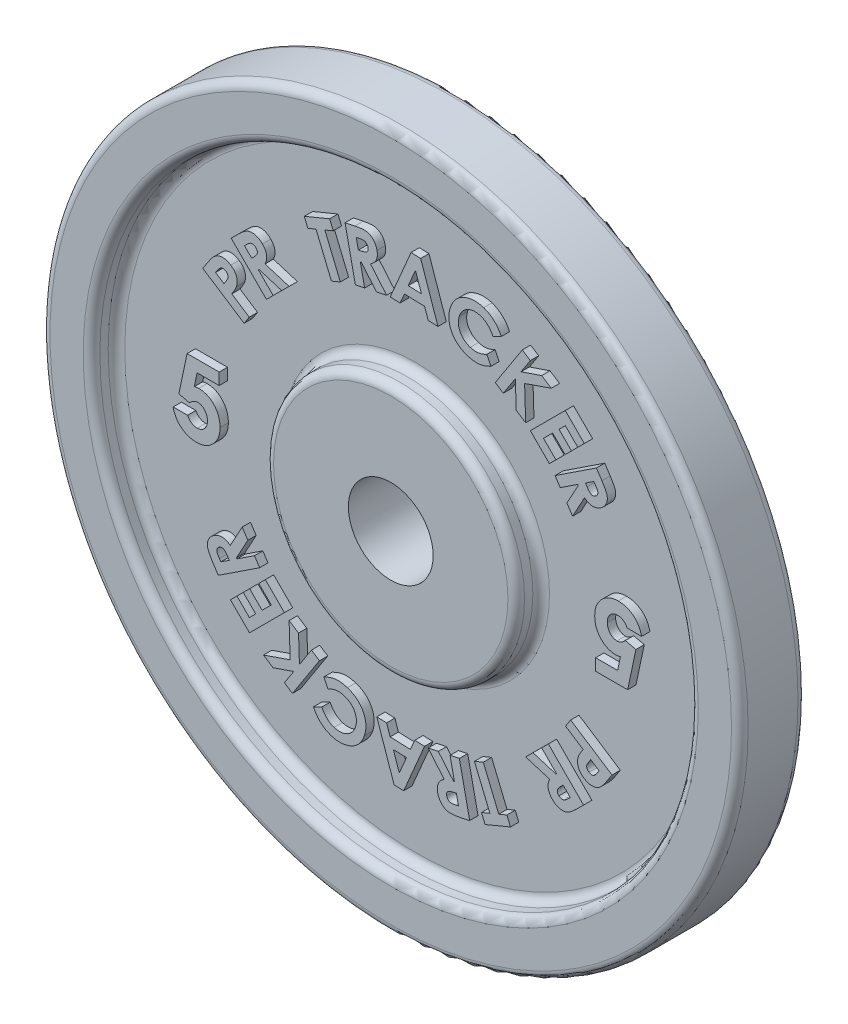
from build123d import *

# Parameters (mm, degrees)
ESBO_O1_R                = 21
ESBO_O1_R_2              = 2.55
RESSALTO_EXTRUS_O1_DEPTH = 4
ESBO_O2_R                = 18
ESBO_O2_R_2              = 7.55
CORTE_EXTRUS_O1_DEPTH    = 1.5
FILETE1_R                = 0.5
RESSALTO_EXTRUS_O2_DEPTH = 0.5
RESSALTO_EXTRUS_O3_DEPTH = 0.5
PADR_OCIRCULAR1_COUNT    = 2
FILETE2_R                = 0.5
FILETE3_R                = 0.5
RESSALTO_EXTRUS_O4_DEPTH = 0.5
RESSALTO_EXTRUS_O5_DEPTH = 0.5
PADR_OCIRCULAR2_COUNT    = 2


with BuildPart() as part:
    # Esbo_o1 → Ressalto-extrus_o1 (new body)
    with BuildSketch(Plane.XY):
        Circle(ESBO_O1_R)
        Circle(ESBO_O1_R_2, mode=Mode.SUBTRACT)
    extrude(amount=RESSALTO_EXTRUS_O1_DEPTH)

    # Esbo_o2 → Corte-extrus_o1 (cut)
    with BuildSketch(Plane.XY.offset(4)):
        Circle(ESBO_O2_R)
        Circle(ESBO_O2_R_2, mode=Mode.SUBTRACT)
    corte_extrus_o1 = extrude(amount=-CORTE_EXTRUS_O1_DEPTH, mode=Mode.SUBTRACT)

    # Filete1
    filete1_edges = [part.edges().sort_by_distance(p)[0] for p in [
        (-7.55, 0, 4),
        (-18, 0, 2.5),
        (-7.55, 0, 2.5),
        (-18, 0, 4),
    ]]
    fillet(filete1_edges, radius=FILETE1_R)

    # Esbo_o3 → Ressalto-extrus_o2 (add)
    # profile 1 of 9: a face of its own
    with BuildSketch(Plane.XY.offset(2.5)):
        with BuildLine():
            Line((11.372106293, 8.482696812), (11.70263514, 7.980893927))
            add(Edge.make_bspline(
                [(11.70263514, 7.980893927), (11.724196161, 7.947521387), (11.76576219, 7.883184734), (11.823642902, 7.789141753), (11.873676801, 7.700688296), (11.916269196, 7.618168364), (11.9531268, 7.542072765), (11.980870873, 7.471076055), (12.003586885, 7.406664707), (12.021625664, 7.328534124), (12.03179376, 7.234371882), (12.026669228, 7.122080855), (12.001764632, 7.010507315), (11.967025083, 6.919591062), (11.931859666, 6.848115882), (11.899674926, 6.79663945), (11.864071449, 6.746943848), (11.824230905, 6.699405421), (11.780243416, 6.653640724), (11.732185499, 6.609991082), (11.680364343, 6.567911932), (11.642951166, 6.542901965), (11.623909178, 6.530172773)],
                knots=[0, 0, 0, 0, 1.424579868, 2.746350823, 3.958867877, 5.067175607, 6.076040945, 6.988342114, 7.799210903, 8.522229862, 9.85875015, 11.181925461, 12.534388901, 13.939130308, 14.6618638, 15.387446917, 16.113030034, 16.852417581, 17.609320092, 18.387197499, 19.179140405, 20, 20, 20, 20], degree=3))
            add(Edge.make_bspline(
                [(11.623909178, 6.530172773), (11.603651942, 6.517253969), (11.563893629, 6.491898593), (11.502471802, 6.459700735), (11.441435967, 6.4320533), (11.380132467, 6.410855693), (11.319315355, 6.393320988), (11.258225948, 6.382908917), (11.197384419, 6.37656645), (11.136436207, 6.37605724), (11.075684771, 6.380787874), (11.01502661, 6.391326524), (10.954290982, 6.40654737), (10.894169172, 6.429160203), (10.833127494, 6.454272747), (10.77304555, 6.486804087), (10.712688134, 6.523926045), (10.673802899, 6.552333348), (10.653957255, 6.566831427)],
                knots=[0, 0, 0, 0, 1.102086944, 2.163035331, 3.179481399, 4.173821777, 5.137300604, 6.080390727, 7.013391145, 7.941897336, 8.873265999, 9.805722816, 10.76445368, 11.741476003, 12.750579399, 13.790977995, 14.872593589, 16, 16, 16, 16], degree=3))
            Line((10.653957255, 6.566831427), (9.936409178, 5.250124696))
            Line((9.936409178, 5.250124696), (9.595663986, 5.766951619))
            Line((9.595663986, 5.766951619), (10.279558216, 7.020557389))
            Line((10.279558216, 7.020557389), (10.250712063, 7.065028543))
            Line((10.250712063, 7.065028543), (9.197827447, 6.370917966))
            Line((9.197827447, 6.370917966), (8.885928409, 6.843874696))
            Line((8.885928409, 6.843874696), (11.372106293, 8.482696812))
        make_face()
        with BuildLine():
            Line((10.712250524, 7.369115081), (10.810207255, 7.220076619))
            add(Edge.make_bspline(
                [(10.810207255, 7.220076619), (10.82222925, 7.201908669), (10.845308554, 7.167030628), (10.881668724, 7.119046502), (10.916195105, 7.076232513), (10.949997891, 7.039374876), (10.982453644, 7.008009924), (11.013544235, 6.981619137), (11.044400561, 6.961738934), (11.083194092, 6.942255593), (11.134321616, 6.929880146), (11.19829258, 6.932687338), (11.264419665, 6.953846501), (11.305669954, 6.978554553), (11.32763514, 6.991711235)],
                knots=[0, 0, 0, 0, 1.203101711, 2.309662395, 3.324143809, 4.240453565, 5.070005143, 5.816667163, 6.488851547, 7.092611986, 8.2090873, 9.349703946, 10.588755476, 12, 12, 12, 12], degree=3))
            add(Edge.make_bspline(
                [(11.32763514, 6.991711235), (11.340342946, 7.000767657), (11.365409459, 7.01863171), (11.397276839, 7.051005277), (11.422317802, 7.087453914), (11.441728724, 7.126408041), (11.454266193, 7.167891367), (11.460187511, 7.210446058), (11.460451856, 7.253814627), (11.452661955, 7.300191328), (11.434169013, 7.353004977), (11.403911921, 7.416123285), (11.360818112, 7.491805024), (11.326138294, 7.545387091), (11.307202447, 7.574643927)],
                knots=[0, 0, 0, 0, 0.842179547, 1.661223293, 2.4389524, 3.223208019, 4.003944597, 4.769372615, 5.537932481, 6.338747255, 7.29721474, 8.551489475, 10.117047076, 12, 12, 12, 12], degree=3))
            Line((11.307202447, 7.574643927), (11.221264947, 7.705052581))
            Line((11.221264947, 7.705052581), (10.712250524, 7.369115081))
        make_face(mode=Mode.SUBTRACT)
    # profile 2 of 9: a face of its own
    with BuildSketch(Plane.XY.offset(2.5)):
        Polygon((9.497131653, 10.539133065), (10.643766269, 9.392498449), (10.252540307, 9.001272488), (9.503141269, 9.750671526), (9.123333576, 9.370863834), (9.872732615, 8.621464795), (9.488718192, 8.237450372), (8.739319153, 8.986849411), (8.187035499, 8.434565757), (8.936434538, 7.685166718), (8.544006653, 7.292738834), (7.397372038, 8.439373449), align=None)
    # profile 3 of 9: a face of its own
    with BuildSketch(Plane.XY.offset(2.5)):
        Polygon((6.914354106, 12.404591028), (7.398128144, 12.092091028), (6.838632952, 11.227307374), (8.080219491, 11.650384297), (8.655940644, 11.277788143), (7.053176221, 10.72550449), (7.11507526, 8.709278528), (6.547767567, 9.075865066), (6.494281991, 10.69425449), (5.771926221, 9.578268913), (5.288152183, 9.890768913), align=None)
    # profile 4 of 9: a face of its own
    with BuildSketch(Plane.XY.offset(2.5)):
        with BuildLine():
            Line((5.643245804, 12.465489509), (5.14564965, 12.22750874))
            add(Edge.make_bspline(
                [(5.14564965, 12.22750874), (5.124240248, 12.270637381), (5.08238287, 12.354957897), (5.00706436, 12.470935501), (4.925885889, 12.576147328), (4.8364413, 12.668755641), (4.740854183, 12.750845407), (4.636864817, 12.819650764), (4.526124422, 12.877448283), (4.447693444, 12.906043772), (4.408269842, 12.920417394)],
                knots=[0, 0, 0, 0, 1.108720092, 2.167651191, 3.18060078, 4.166538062, 5.129360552, 6.078037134, 7.033918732, 8, 8, 8, 8], degree=3))
            add(Edge.make_bspline(
                [(4.408269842, 12.920417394), (4.374572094, 12.930426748), (4.308244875, 12.950128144), (4.20743273, 12.969055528), (4.107941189, 12.976362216), (4.009462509, 12.975892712), (3.912242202, 12.963380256), (3.815944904, 12.941789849), (3.72111022, 12.909667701), (3.628914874, 12.867530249), (3.540271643, 12.818525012), (3.458639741, 12.760702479), (3.383840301, 12.69679356), (3.317503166, 12.624839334), (3.257358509, 12.547286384), (3.205773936, 12.461756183), (3.160882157, 12.369669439), (3.137626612, 12.304480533), (3.125817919, 12.271378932)],
                knots=[0, 0, 0, 0, 1.052060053, 2.070767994, 3.063437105, 4.035120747, 5.014106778, 5.991861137, 6.985689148, 8.005720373, 9.023421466, 10.013478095, 10.995783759, 11.96331235, 12.938580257, 13.929127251, 14.948452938, 16, 16, 16, 16], degree=3))
            add(Edge.make_bspline(
                [(3.125817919, 12.271378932), (3.118498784, 12.247826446), (3.104097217, 12.201483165), (3.088054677, 12.131334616), (3.075938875, 12.062137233), (3.067945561, 11.993527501), (3.06487748, 11.925441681), (3.066897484, 11.858001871), (3.072609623, 11.791291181), (3.083667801, 11.725686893), (3.098584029, 11.661415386), (3.117746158, 11.598917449), (3.141327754, 11.538489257), (3.169232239, 11.47995944), (3.200812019, 11.422929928), (3.237072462, 11.368310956), (3.277089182, 11.31540859), (3.321216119, 11.264964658), (3.368772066, 11.216562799), (3.419521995, 11.171968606), (3.473001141, 11.130439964), (3.529513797, 11.092992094), (3.588517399, 11.057556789), (3.650877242, 11.026911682), (3.715625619, 10.998527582), (3.760506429, 10.983385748), (3.783269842, 10.975705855)],
                knots=[0, 0, 0, 0, 1.08983963, 2.1444336, 3.178001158, 4.193971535, 5.19552419, 6.187598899, 7.174443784, 8.152670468, 9.125633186, 10.089121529, 11.039541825, 11.990127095, 12.953371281, 13.918526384, 14.88546701, 15.883372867, 16.878918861, 17.882661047, 18.867398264, 19.869381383, 20.877721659, 21.907298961, 22.938588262, 24, 24, 24, 24], degree=3))
            add(Edge.make_bspline(
                [(3.783269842, 10.975705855), (3.82212513, 10.96407343), (3.898580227, 10.941184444), (4.015139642, 10.921347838), (4.130158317, 10.915055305), (4.225424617, 10.918680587), (4.301950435, 10.930417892), (4.362185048, 10.942341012), (4.425160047, 10.95866318), (4.490718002, 10.979184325), (4.558828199, 11.004016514), (4.62946354, 11.032959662), (4.703130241, 11.065380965), (4.752502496, 11.089513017), (4.777861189, 11.101907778)],
                knots=[0, 0, 0, 0, 1.412340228, 2.779045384, 4.10748043, 5.421237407, 6.091506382, 6.803337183, 7.560088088, 8.35707087, 9.196132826, 10.085318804, 11.016576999, 12, 12, 12, 12], degree=3))
            Line((4.777861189, 11.101907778), (5.020048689, 10.599503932))
            add(Edge.make_bspline(
                [(5.020048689, 10.599503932), (4.986137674, 10.582965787), (4.91971388, 10.550571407), (4.819970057, 10.508372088), (4.723678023, 10.470788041), (4.630302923, 10.438698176), (4.539814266, 10.412426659), (4.452316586, 10.390824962), (4.367745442, 10.376061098), (4.285510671, 10.365955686), (4.204189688, 10.362076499), (4.122362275, 10.362044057), (4.039098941, 10.366209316), (3.95461992, 10.375168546), (3.868879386, 10.389396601), (3.781937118, 10.407109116), (3.69381468, 10.430250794), (3.635166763, 10.448440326), (3.605385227, 10.457677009)],
                knots=[0, 0, 0, 0, 1.235616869, 2.420286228, 3.546204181, 4.621062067, 5.653067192, 6.631820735, 7.5714333, 8.463446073, 9.343896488, 10.236271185, 11.14293321, 12.073336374, 13.017223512, 13.98880256, 14.978709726, 16, 16, 16, 16], degree=3))
            add(Edge.make_bspline(
                [(3.605385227, 10.457677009), (3.551727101, 10.476565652), (3.446398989, 10.513643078), (3.297649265, 10.584292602), (3.161014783, 10.665870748), (3.035742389, 10.757492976), (2.922155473, 10.860013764), (2.820622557, 10.973645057), (2.731387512, 11.098072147), (2.654896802, 11.231948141), (2.591081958, 11.372150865), (2.543576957, 11.517568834), (2.51058845, 11.665663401), (2.494729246, 11.817233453), (2.49340558, 11.971430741), (2.508187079, 12.128829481), (2.538861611, 12.289174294), (2.570587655, 12.395221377), (2.586755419, 12.449263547)],
                knots=[0, 0, 0, 0, 1.087256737, 2.134228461, 3.142668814, 4.126448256, 5.097398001, 6.063225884, 7.034900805, 8.019872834, 9.007433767, 9.975333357, 10.94012752, 11.903376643, 12.884071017, 13.884292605, 14.921823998, 16, 16, 16, 16], degree=3))
            add(Edge.make_bspline(
                [(2.586755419, 12.449263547), (2.598710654, 12.484095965), (2.622351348, 12.552974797), (2.665512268, 12.65208616), (2.712703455, 12.746597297), (2.765297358, 12.83581344), (2.822358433, 12.920395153), (2.885131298, 12.999649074), (2.952295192, 13.074640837), (3.025439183, 13.143444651), (3.102079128, 13.208027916), (3.183365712, 13.26630797), (3.268736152, 13.318674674), (3.357150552, 13.366279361), (3.450083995, 13.4073008), (3.546606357, 13.442756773), (3.647299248, 13.471979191), (3.750740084, 13.496147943), (3.856160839, 13.5133832), (3.962121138, 13.524247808), (4.067899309, 13.528599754), (4.173333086, 13.525669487), (4.278030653, 13.51504725), (4.38247792, 13.499035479), (4.486764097, 13.475736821), (4.555235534, 13.454541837), (4.589760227, 13.443854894)],
                knots=[0, 0, 0, 0, 1.061962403, 2.099961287, 3.115586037, 4.107642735, 5.085323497, 6.056407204, 7.021973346, 7.986605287, 8.950665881, 9.911273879, 10.868678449, 11.838127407, 12.805645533, 13.796506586, 14.802219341, 15.828295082, 16.859046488, 17.881389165, 18.899230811, 19.910902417, 20.921170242, 21.932973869, 22.95776332, 24, 24, 24, 24], degree=3))
            add(Edge.make_bspline(
                [(4.589760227, 13.443854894), (4.618936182, 13.433780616), (4.676886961, 13.413770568), (4.761345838, 13.377748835), (4.843666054, 13.338236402), (4.923879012, 13.294368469), (5.001343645, 13.245522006), (5.076553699, 13.192561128), (5.149572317, 13.135420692), (5.219496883, 13.073515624), (5.286779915, 13.008408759), (5.349692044, 12.939580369), (5.409691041, 12.868696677), (5.464914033, 12.794246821), (5.515403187, 12.716290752), (5.562227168, 12.635625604), (5.605999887, 12.552367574), (5.630803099, 12.494512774), (5.643245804, 12.465489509)],
                knots=[0, 0, 0, 0, 0.998866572, 1.984000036, 2.970072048, 3.953860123, 4.941572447, 5.932833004, 6.93037271, 7.941144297, 8.954553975, 9.959547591, 10.958329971, 11.959530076, 12.957722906, 13.963113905, 14.978181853, 16, 16, 16, 16], degree=3))
        make_face()
    # profile 5 of 9: a face of its own
    with BuildSketch(Plane.XY.offset(2.5)):
        Polygon((0.221709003, 14.132780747), (0.798031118, 14.112949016), (1.841300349, 11.088910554), (1.251156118, 11.109343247), (1.039617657, 11.732540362), (-0.177329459, 11.775208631), (-0.442353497, 11.168838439), (-1.03309869, 11.189271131), align=None)
        Polygon((0.48613208, 13.331098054), (0.05283881, 12.320881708), (0.84550708, 12.293237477), align=None, mode=Mode.SUBTRACT)
    # profile 6 of 9: a face of its own
    with BuildSketch(Plane.XY.offset(2.5)):
        with BuildLine():
            Line((-3.748977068, 13.699248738), (-3.157630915, 13.825450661))
            add(Edge.make_bspline(
                [(-3.157630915, 13.825450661), (-3.11861599, 13.833511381), (-3.043380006, 13.849055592), (-2.934083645, 13.867484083), (-2.832907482, 13.882026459), (-2.739971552, 13.892808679), (-2.655085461, 13.897468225), (-2.578472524, 13.898277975), (-2.509931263, 13.895221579), (-2.448440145, 13.886614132), (-2.392018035, 13.873700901), (-2.338344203, 13.856855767), (-2.286494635, 13.835739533), (-2.236425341, 13.810444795), (-2.18841238, 13.780791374), (-2.141582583, 13.747562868), (-2.096919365, 13.709826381), (-2.054116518, 13.66827923), (-2.014059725, 13.623221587), (-1.976360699, 13.575329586), (-1.943582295, 13.523161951), (-1.91349983, 13.46837792), (-1.886135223, 13.410817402), (-1.863720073, 13.349652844), (-1.843355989, 13.285833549), (-1.833382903, 13.241604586), (-1.828303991, 13.219080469)],
                knots=[0, 0, 0, 0, 1.704973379, 3.287853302, 4.742851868, 6.079738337, 7.290568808, 8.379457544, 9.358207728, 10.223935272, 11.033000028, 11.832927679, 12.628986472, 13.426521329, 14.230847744, 15.042135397, 15.881916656, 16.730752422, 17.592991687, 18.460754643, 19.335982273, 20.226199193, 21.135209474, 22.060410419, 23.012241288, 24, 24, 24, 24], degree=3))
            add(Edge.make_bspline(
                [(-1.828303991, 13.219080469), (-1.823872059, 13.195484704), (-1.815156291, 13.14908165), (-1.806151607, 13.079895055), (-1.804393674, 13.012561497), (-1.805508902, 12.947236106), (-1.813270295, 12.884248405), (-1.824014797, 12.822858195), (-1.842141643, 12.764069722), (-1.863436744, 12.706792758), (-1.890100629, 12.651605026), (-1.922242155, 12.59876618), (-1.958776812, 12.547363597), (-2.001295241, 12.498744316), (-2.048305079, 12.451798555), (-2.100051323, 12.406492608), (-2.157370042, 12.363888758), (-2.198138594, 12.337636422), (-2.218928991, 12.324248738)],
                knots=[0, 0, 0, 0, 1.09581435, 2.155011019, 3.179669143, 4.167483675, 5.133737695, 6.073368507, 7.007780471, 7.936629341, 8.860786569, 9.800016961, 10.756576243, 11.735379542, 12.74392103, 13.787214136, 14.871564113, 16, 16, 16, 16], degree=3))
            Line((-2.218928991, 12.324248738), (-1.24957803, 11.169801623))
            Line((-1.24957803, 11.169801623), (-1.858352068, 11.040594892))
            Line((-1.858352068, 11.040594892), (-2.78082803, 12.140955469))
            Line((-2.78082803, 12.140955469), (-2.832510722, 12.130138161))
            Line((-2.832510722, 12.130138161), (-2.569289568, 10.889753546))
            Line((-2.569289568, 10.889753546), (-3.126981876, 10.770763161))
            Line((-3.126981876, 10.770763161), (-3.748977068, 13.699248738))
        make_face()
        with BuildLine():
            Line((-2.947895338, 12.673407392), (-2.77301553, 12.710066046))
            add(Edge.make_bspline(
                [(-2.77301553, 12.710066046), (-2.751752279, 12.714951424), (-2.710882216, 12.724341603), (-2.652449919, 12.739833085), (-2.599637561, 12.7564915), (-2.55256387, 12.774327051), (-2.511544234, 12.793726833), (-2.475741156, 12.813396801), (-2.445380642, 12.834177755), (-2.420718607, 12.857047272), (-2.400569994, 12.881222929), (-2.384681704, 12.907606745), (-2.372570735, 12.936138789), (-2.364310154, 12.966885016), (-2.3592735, 12.999749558), (-2.35908776, 13.034847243), (-2.361960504, 13.072080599), (-2.366720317, 13.097320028), (-2.369169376, 13.11030643)],
                knots=[0, 0, 0, 0, 1.598184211, 3.071867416, 4.427024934, 5.653385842, 6.756228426, 7.748257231, 8.643888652, 9.443485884, 10.204445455, 10.941834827, 11.691389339, 12.467479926, 13.268557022, 14.119810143, 15.03258895, 16, 16, 16, 16], degree=3))
            add(Edge.make_bspline(
                [(-2.369169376, 13.11030643), (-2.372857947, 13.125700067), (-2.380042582, 13.155683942), (-2.399338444, 13.197067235), (-2.423545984, 13.234165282), (-2.452965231, 13.266917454), (-2.487429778, 13.29339287), (-2.524430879, 13.316209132), (-2.56574844, 13.330438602), (-2.602384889, 13.339094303), (-2.634940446, 13.342056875), (-2.663868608, 13.342735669), (-2.696718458, 13.340386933), (-2.733862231, 13.337731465), (-2.774906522, 13.332025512), (-2.82036844, 13.324713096), (-2.869883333, 13.315816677), (-2.904241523, 13.308704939), (-2.922053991, 13.305017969)],
                knots=[0, 0, 0, 0, 1.131166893, 2.203297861, 3.249782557, 4.295873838, 5.337726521, 6.353877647, 7.393258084, 8.45137998, 9.042365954, 9.731131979, 10.521344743, 11.399396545, 12.397667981, 13.487316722, 14.697338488, 16, 16, 16, 16], degree=3))
            Line((-2.922053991, 13.305017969), (-3.075299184, 13.272566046))
            Line((-3.075299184, 13.272566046), (-2.947895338, 12.673407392))
        make_face(mode=Mode.SUBTRACT)
    # profile 7 of 9: a face of its own
    with BuildSketch(Plane.XY.offset(2.5)):
        Polygon((-6.202171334, 12.807926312), (-4.675128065, 13.440738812), (-4.459983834, 12.922109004), (-4.963589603, 12.712974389), (-4.033902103, 10.468984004), (-4.566954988, 10.24843112), (-5.496642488, 12.492421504), (-5.987027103, 12.289296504), align=None)
    # profile 8 of 9: a face of its own
    with BuildSketch(Plane.XY.offset(2.5)):
        with BuildLine():
            Line((-10.599505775, 9.467272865), (-10.169818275, 9.895758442))
            add(Edge.make_bspline(
                [(-10.169818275, 9.895758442), (-10.141316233, 9.923753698), (-10.086316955, 9.977775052), (-10.004693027, 10.053245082), (-9.927847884, 10.121209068), (-9.854635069, 10.179596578), (-9.786650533, 10.230950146), (-9.722492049, 10.272906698), (-9.66276536, 10.307043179), (-9.58963716, 10.341521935), (-9.498181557, 10.370464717), (-9.385940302, 10.386720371), (-9.270852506, 10.385232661), (-9.174136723, 10.36969788), (-9.097020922, 10.348445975), (-9.039330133, 10.327835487), (-8.983116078, 10.302648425), (-8.927889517, 10.272904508), (-8.874022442, 10.238562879), (-8.820893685, 10.200242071), (-8.769754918, 10.156522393), (-8.73697313, 10.125088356), (-8.720299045, 10.109099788)],
                knots=[0, 0, 0, 0, 1.421133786, 2.742306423, 3.954344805, 5.069496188, 6.072872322, 6.984049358, 7.794588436, 8.518273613, 9.856972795, 11.189283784, 12.536208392, 13.936227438, 14.660613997, 15.379652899, 16.113338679, 16.849856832, 17.609021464, 18.384434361, 19.178260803, 20, 20, 20, 20], degree=3))
            add(Edge.make_bspline(
                [(-8.720299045, 10.109099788), (-8.703367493, 10.091744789), (-8.670215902, 10.057764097), (-8.626574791, 10.003113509), (-8.587171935, 9.948329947), (-8.552602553, 9.892608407), (-8.524439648, 9.835297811), (-8.501444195, 9.777178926), (-8.483314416, 9.718356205), (-8.470503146, 9.658431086), (-8.463587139, 9.597468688), (-8.460710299, 9.53555021), (-8.464938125, 9.472467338), (-8.473067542, 9.408335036), (-8.487039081, 9.343233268), (-8.506670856, 9.277286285), (-8.530984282, 9.210072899), (-8.551304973, 9.165854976), (-8.561645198, 9.143354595)],
                knots=[0, 0, 0, 0, 1.103197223, 2.160034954, 3.179906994, 4.174678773, 5.141294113, 6.082891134, 7.017573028, 7.940524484, 8.868105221, 9.808155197, 10.758194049, 11.742332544, 12.749361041, 13.785374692, 14.873083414, 16, 16, 16, 16], degree=3))
            Line((-8.561645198, 9.143354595), (-7.116332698, 8.698643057))
            Line((-7.116332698, 8.698643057), (-7.558640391, 8.258138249))
            Line((-7.558640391, 8.258138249), (-8.934842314, 8.681816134))
            Line((-8.934842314, 8.681816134), (-8.972101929, 8.644556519))
            Line((-8.972101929, 8.644556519), (-8.074866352, 7.743715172))
            Line((-8.074866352, 7.743715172), (-8.479914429, 7.339869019))
            Line((-8.479914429, 7.339869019), (-10.599505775, 9.467272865))
        make_face()
        with BuildLine():
            Line((-9.365731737, 9.039388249), (-9.238928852, 9.165590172))
            add(Edge.make_bspline(
                [(-9.238928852, 9.165590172), (-9.223627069, 9.181339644), (-9.1941939, 9.211633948), (-9.153196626, 9.256307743), (-9.118169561, 9.299445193), (-9.087893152, 9.33978526), (-9.063884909, 9.378651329), (-9.04410206, 9.414677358), (-9.030162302, 9.448956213), (-9.018589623, 9.491275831), (-9.016852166, 9.544258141), (-9.031818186, 9.607060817), (-9.066072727, 9.668099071), (-9.098869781, 9.703716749), (-9.116332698, 9.722681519)],
                knots=[0, 0, 0, 0, 1.202674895, 2.313360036, 3.319177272, 4.245179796, 5.073189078, 5.819223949, 6.493567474, 7.094979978, 8.214892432, 9.353828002, 10.591035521, 12, 12, 12, 12], degree=3))
            add(Edge.make_bspline(
                [(-9.116332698, 9.722681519), (-9.127824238, 9.733508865), (-9.150421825, 9.754800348), (-9.189346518, 9.779172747), (-9.230006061, 9.797904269), (-9.272853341, 9.80847089), (-9.316140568, 9.812471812), (-9.359674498, 9.811300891), (-9.402203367, 9.800892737), (-9.43762212, 9.788141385), (-9.46625409, 9.772592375), (-9.490907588, 9.757895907), (-9.517199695, 9.737993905), (-9.546842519, 9.715441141), (-9.578406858, 9.688202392), (-9.612880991, 9.65736726), (-9.649898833, 9.622852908), (-9.674898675, 9.597956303), (-9.687847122, 9.585061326)],
                knots=[0, 0, 0, 0, 1.125004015, 2.212269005, 3.262387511, 4.310165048, 5.344972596, 6.361525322, 7.402641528, 8.457426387, 9.039724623, 9.726656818, 10.504926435, 11.391944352, 12.386519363, 13.4806323, 14.695115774, 16, 16, 16, 16], degree=3))
            Line((-9.687847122, 9.585061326), (-9.799025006, 9.474484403))
            Line((-9.799025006, 9.474484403), (-9.365731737, 9.039388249))
        make_face(mode=Mode.SUBTRACT)
    # profile 9 of 9: a face of its own
    with BuildSketch(Plane.XY.offset(2.5)):
        with BuildLine():
            Line((-12.308870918, 7.044325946), (-11.98134688, 7.546128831))
            add(Edge.make_bspline(
                [(-11.98134688, 7.546128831), (-11.959636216, 7.578665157), (-11.917812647, 7.641343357), (-11.855330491, 7.730623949), (-11.794968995, 7.811310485), (-11.735855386, 7.882605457), (-11.68030535, 7.94608901), (-11.626652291, 8.000619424), (-11.575068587, 8.046433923), (-11.52510025, 8.084536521), (-11.475246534, 8.115763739), (-11.425066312, 8.142230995), (-11.373249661, 8.163866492), (-11.320451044, 8.182383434), (-11.265729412, 8.194956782), (-11.210059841, 8.20521918), (-11.152905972, 8.209628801), (-11.074873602, 8.210581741), (-10.975389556, 8.200198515), (-10.856174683, 8.170027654), (-10.737536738, 8.119701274), (-10.662507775, 8.074349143), (-10.623774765, 8.050936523)],
                knots=[0, 0, 0, 0, 1.407136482, 2.710717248, 3.919990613, 5.030955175, 6.041784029, 6.953954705, 7.781053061, 8.521898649, 9.211703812, 9.895079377, 10.560316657, 11.230338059, 11.905032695, 12.577993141, 13.26504473, 13.964123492, 15.383954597, 16.848671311, 18.373155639, 20, 20, 20, 20], degree=3))
            add(Edge.make_bspline(
                [(-10.623774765, 8.050936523), (-10.602739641, 8.036594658), (-10.561692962, 8.0086088), (-10.504605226, 7.962631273), (-10.45359978, 7.913595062), (-10.406916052, 7.863064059), (-10.367281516, 7.808759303), (-10.331957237, 7.752813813), (-10.302615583, 7.694018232), (-10.279094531, 7.632979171), (-10.261259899, 7.570345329), (-10.247856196, 7.50671609), (-10.240040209, 7.441975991), (-10.237618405, 7.376441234), (-10.240851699, 7.310158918), (-10.248630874, 7.243056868), (-10.261786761, 7.174910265), (-10.274673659, 7.129776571), (-10.281226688, 7.106825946)],
                knots=[0, 0, 0, 0, 1.124608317, 2.194493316, 3.233698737, 4.248804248, 5.229486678, 6.199567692, 7.169325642, 8.127585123, 9.085599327, 10.043777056, 10.997776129, 11.963162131, 12.9377548, 13.92690783, 14.945826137, 16, 16, 16, 16], degree=3))
            add(Edge.make_bspline(
                [(-10.281226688, 7.106825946), (-10.286271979, 7.092141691), (-10.297181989, 7.060388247), (-10.318515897, 7.010437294), (-10.346025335, 6.954630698), (-10.378136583, 6.891893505), (-10.417824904, 6.823723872), (-10.461958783, 6.748474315), (-10.512639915, 6.667567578), (-10.548589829, 6.611791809), (-10.56728438, 6.582787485)],
                knots=[0, 0, 0, 0, 0.622537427, 1.346183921, 2.176173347, 3.117576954, 4.171813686, 5.338785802, 6.616124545, 8, 8, 8, 8], degree=3))
            Line((-10.56728438, 6.582787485), (-9.514399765, 5.896489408))
            Line((-9.514399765, 5.896489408), (-9.822693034, 5.423532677))
            Line((-9.822693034, 5.423532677), (-12.308870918, 7.044325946))
        make_face()
        with BuildLine():
            Line((-11.028822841, 6.883869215), (-10.930265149, 7.034710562))
            add(Edge.make_bspline(
                [(-10.930265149, 7.034710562), (-10.912702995, 7.062157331), (-10.880443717, 7.112573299), (-10.840977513, 7.184219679), (-10.811208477, 7.243531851), (-10.794506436, 7.294263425), (-10.787318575, 7.338945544), (-10.787502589, 7.380666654), (-10.793223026, 7.421802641), (-10.806926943, 7.461344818), (-10.825809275, 7.499358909), (-10.8519373, 7.534169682), (-10.883729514, 7.566495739), (-10.90929918, 7.583999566), (-10.922452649, 7.593003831)],
                knots=[0, 0, 0, 0, 1.82986352, 3.361209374, 4.594483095, 5.551825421, 6.349238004, 7.125730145, 7.888067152, 8.670975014, 9.466161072, 10.26293814, 11.106426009, 12, 12, 12, 12], degree=3))
            add(Edge.make_bspline(
                [(-10.922452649, 7.593003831), (-10.934309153, 7.600318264), (-10.957170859, 7.614421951), (-10.993212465, 7.630081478), (-11.028808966, 7.641335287), (-11.064689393, 7.646638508), (-11.100257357, 7.647302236), (-11.135694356, 7.643086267), (-11.17099314, 7.633435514), (-11.193419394, 7.622991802), (-11.204904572, 7.617643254)],
                knots=[0, 0, 0, 0, 1.120226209, 2.160019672, 3.154816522, 4.117323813, 5.068961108, 6.011122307, 6.981434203, 8, 8, 8, 8], degree=3))
            add(Edge.make_bspline(
                [(-11.204904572, 7.617643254), (-11.213847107, 7.612843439), (-11.232650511, 7.602750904), (-11.260106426, 7.582112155), (-11.288481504, 7.556232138), (-11.318961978, 7.525451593), (-11.349627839, 7.488436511), (-11.383023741, 7.447308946), (-11.416466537, 7.399919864), (-11.438948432, 7.366486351), (-11.450697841, 7.349013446)],
                knots=[0, 0, 0, 0, 0.661727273, 1.391409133, 2.234074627, 3.167977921, 4.216097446, 5.369899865, 6.625466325, 8, 8, 8, 8], degree=3))
            Line((-11.450697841, 7.349013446), (-11.537837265, 7.215599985))
            Line((-11.537837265, 7.215599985), (-11.028822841, 6.883869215))
        make_face(mode=Mode.SUBTRACT)
    ressalto_extrus_o2 = extrude(amount=RESSALTO_EXTRUS_O2_DEPTH)

    # Esbo_o5 → Ressalto-extrus_o3 (add)
    with BuildSketch(Plane.XY.offset(2.5)):
        with BuildLine():
            Line((-13.251668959, 2.133333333), (-11.324111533, 2.133333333))
            Line((-11.324111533, 2.133333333), (-11.324111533, 1.427777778))
            Line((-11.324111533, 1.427777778), (-12.649572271, 1.427777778))
            Line((-12.649572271, 1.427777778), (-12.814936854, 0.62724359))
            add(Edge.make_bspline(
                [(-12.814936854, 0.62724359), (-12.792403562, 0.633519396), (-12.747963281, 0.645896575), (-12.681013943, 0.65830932), (-12.616130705, 0.666354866), (-12.573554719, 0.667428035), (-12.552897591, 0.667948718)],
                knots=[0, 0, 0, 0, 1.05461699, 2.079921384, 3.068411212, 4, 4, 4, 4], degree=3))
            add(Edge.make_bspline(
                [(-12.552897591, 0.667948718), (-12.507883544, 0.666917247), (-12.419150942, 0.664883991), (-12.289346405, 0.645581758), (-12.165050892, 0.615181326), (-12.046644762, 0.571824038), (-11.934243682, 0.515393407), (-11.827711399, 0.447128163), (-11.726917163, 0.366908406), (-11.633651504, 0.274683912), (-11.54795512, 0.173419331), (-11.473447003, 0.06389097), (-11.40981242, -0.052339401), (-11.359199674, -0.175994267), (-11.319251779, -0.306296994), (-11.290384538, -0.443331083), (-11.273313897, -0.587258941), (-11.271012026, -0.685450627), (-11.269838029, -0.735530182)],
                knots=[0, 0, 0, 0, 1.01440847, 1.999622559, 2.951875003, 3.895578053, 4.836219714, 5.782137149, 6.743708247, 7.735272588, 8.734977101, 9.730283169, 10.717124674, 11.717316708, 12.737475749, 13.78628267, 14.87096371, 16, 16, 16, 16], degree=3))
            add(Edge.make_bspline(
                [(-11.269838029, -0.735530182), (-11.271272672, -0.786178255), (-11.274103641, -0.886121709), (-11.29257312, -1.033073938), (-11.325172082, -1.173820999), (-11.369950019, -1.308739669), (-11.428942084, -1.436838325), (-11.499888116, -1.559443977), (-11.583987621, -1.675646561), (-11.680415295, -1.784254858), (-11.785244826, -1.883524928), (-11.89686353, -1.970852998), (-12.014487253, -2.044338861), (-12.138118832, -2.103727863), (-12.267048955, -2.150715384), (-12.401316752, -2.184920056), (-12.541574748, -2.204534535), (-12.636791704, -2.20719482), (-12.685189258, -2.208547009)],
                knots=[0, 0, 0, 0, 1.06808661, 2.107647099, 3.116961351, 4.110378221, 5.100014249, 6.085620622, 7.093190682, 8.119403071, 9.144090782, 10.133780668, 11.103064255, 12.062861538, 13.020824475, 13.992378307, 14.979551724, 16, 16, 16, 16], degree=3))
            add(Edge.make_bspline(
                [(-12.685189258, -2.208547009), (-12.728469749, -2.207440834), (-12.813827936, -2.205259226), (-12.939556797, -2.191849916), (-13.060773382, -2.16814213), (-13.176834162, -2.133830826), (-13.28896029, -2.091601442), (-13.395855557, -2.038785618), (-13.498107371, -1.976389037), (-13.595425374, -1.905550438), (-13.686228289, -1.825753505), (-13.769103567, -1.738402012), (-13.844552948, -1.644596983), (-13.910961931, -1.54318115), (-13.968122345, -1.434304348), (-14.018813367, -1.319249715), (-14.060304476, -1.196815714), (-14.081360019, -1.111937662), (-14.092060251, -1.068803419)],
                knots=[0, 0, 0, 0, 1.054957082, 2.080596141, 3.077793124, 4.061112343, 5.027190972, 5.994718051, 6.962465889, 7.943658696, 8.924948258, 9.904494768, 10.875059, 11.855380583, 12.854004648, 13.869083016, 14.917087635, 16, 16, 16, 16], degree=3))
            Line((-14.092060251, -1.068803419), (-13.223684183, -1.068803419))
            add(Edge.make_bspline(
                [(-13.223684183, -1.068803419), (-13.207810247, -1.098693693), (-13.176961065, -1.15678203), (-13.118279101, -1.233903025), (-13.052588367, -1.299668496), (-12.980481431, -1.354720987), (-12.901491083, -1.395965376), (-12.818836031, -1.427243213), (-12.731477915, -1.445317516), (-12.671983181, -1.447576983), (-12.641940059, -1.448717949)],
                knots=[0, 0, 0, 0, 1.104910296, 2.147267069, 3.153527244, 4.136738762, 5.099945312, 6.05603338, 7.018353, 8, 8, 8, 8], degree=3))
            add(Edge.make_bspline(
                [(-12.641940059, -1.448717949), (-12.621000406, -1.447930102), (-12.579801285, -1.44638), (-12.519100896, -1.438179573), (-12.461159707, -1.42264815), (-12.405546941, -1.40114074), (-12.352113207, -1.374318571), (-12.301624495, -1.340457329), (-12.253202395, -1.301481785), (-12.207584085, -1.256757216), (-12.166267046, -1.206899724), (-12.130036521, -1.153324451), (-12.097641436, -1.09722185), (-12.073645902, -1.036369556), (-12.053995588, -0.972584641), (-12.039524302, -0.905385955), (-12.030876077, -0.834695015), (-12.030075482, -0.786436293), (-12.029667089, -0.76181891)],
                knots=[0, 0, 0, 0, 0.978869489, 1.925942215, 2.855067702, 3.774946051, 4.70828698, 5.642468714, 6.60995405, 7.609372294, 8.622401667, 9.629904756, 10.629323, 11.642352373, 12.678539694, 13.745912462, 14.850161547, 16, 16, 16, 16], degree=3))
            add(Edge.make_bspline(
                [(-12.029667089, -0.76181891), (-12.030141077, -0.737772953), (-12.031063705, -0.690966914), (-12.038695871, -0.622238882), (-12.05234967, -0.557028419), (-12.070953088, -0.494836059), (-12.094767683, -0.436039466), (-12.123870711, -0.380288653), (-12.158386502, -0.327865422), (-12.198500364, -0.279837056), (-12.241277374, -0.235784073), (-12.287233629, -0.197255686), (-12.335955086, -0.165279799), (-12.385927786, -0.13736392), (-12.43914646, -0.117047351), (-12.494414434, -0.10305608), (-12.551673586, -0.092789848), (-12.590728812, -0.092186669), (-12.610563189, -0.091880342)],
                knots=[0, 0, 0, 0, 1.166249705, 2.270133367, 3.348514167, 4.393962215, 5.415026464, 6.420877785, 7.440098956, 8.453121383, 9.451844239, 10.415694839, 11.355045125, 12.27538808, 13.187007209, 14.108269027, 15.039275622, 16, 16, 16, 16], degree=3))
            add(Edge.make_bspline(
                [(-12.610563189, -0.091880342), (-12.632107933, -0.092697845), (-12.675288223, -0.094336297), (-12.739443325, -0.107667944), (-12.802824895, -0.12924355), (-12.8657854, -0.159010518), (-12.927699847, -0.197966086), (-12.990202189, -0.243656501), (-13.051200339, -0.299401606), (-13.089984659, -0.340920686), (-13.110049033, -0.36239984)],
                knots=[0, 0, 0, 0, 0.88288272, 1.769486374, 2.674910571, 3.623812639, 4.617874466, 5.670434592, 6.794841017, 8, 8, 8, 8], degree=3))
            Line((-13.110049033, -0.36239984), (-13.749458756, -0.215691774))
            Line((-13.749458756, -0.215691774), (-13.251668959, 2.133333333))
        make_face()
    ressalto_extrus_o3 = extrude(amount=RESSALTO_EXTRUS_O3_DEPTH)

    # Padr_oCircular1: Ressalto-extrus_o2, Ressalto-extrus_o3 ×2 about axis
    padr_ocircular1_axis = Axis((0, 0, 4), (0, 0, 1))
    add([ressalto_extrus_o2.rotate(padr_ocircular1_axis, i * 360 / PADR_OCIRCULAR1_COUNT) for i in range(1, PADR_OCIRCULAR1_COUNT)])
    add([ressalto_extrus_o3.rotate(padr_ocircular1_axis, i * 360 / PADR_OCIRCULAR1_COUNT) for i in range(1, PADR_OCIRCULAR1_COUNT)])

    # Filete2
    filete2_edges = [part.edges().sort_by_distance(p)[0] for p in [
        (-21, 0, 0),
        (-21, 0, 4),
    ]]
    fillet(filete2_edges, radius=FILETE2_R)

    # Espelhar6: Corte-extrus_o1 across plane
    add(corte_extrus_o1.mirror(Plane.XY.offset(2)), mode=Mode.SUBTRACT)

    # Filete3
    filete3_edges = [part.edges().sort_by_distance(p)[0] for p in [
        (-18, 0, 0),
        (-18, 0, 1.5),
        (-7.55, 0, 0),
    ]]
    fillet(filete3_edges, radius=FILETE3_R)

    # Esbo_o10 → Ressalto-extrus_o4 (add)
    # profile 1 of 9: a face of its own
    with BuildSketch(Plane(origin=(0, 0, 1.5), x_dir=(-1, 0, 0), z_dir=(0, 0, -1))):
        with BuildLine():
            Line((11.372106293, 8.482696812), (11.70263514, 7.980893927))
            add(Edge.make_bspline(
                [(11.70263514, 7.980893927), (11.724196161, 7.947521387), (11.76576219, 7.883184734), (11.823642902, 7.789141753), (11.873676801, 7.700688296), (11.916269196, 7.618168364), (11.9531268, 7.542072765), (11.980870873, 7.471076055), (12.003586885, 7.406664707), (12.021625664, 7.328534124), (12.03179376, 7.234371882), (12.026669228, 7.122080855), (12.001764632, 7.010507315), (11.967025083, 6.919591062), (11.931859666, 6.848115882), (11.899674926, 6.79663945), (11.864071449, 6.746943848), (11.824230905, 6.699405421), (11.780243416, 6.653640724), (11.732185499, 6.609991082), (11.680364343, 6.567911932), (11.642951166, 6.542901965), (11.623909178, 6.530172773)],
                knots=[0, 0, 0, 0, 1.424579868, 2.746350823, 3.958867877, 5.067175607, 6.076040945, 6.988342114, 7.799210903, 8.522229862, 9.85875015, 11.181925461, 12.534388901, 13.939130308, 14.6618638, 15.387446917, 16.113030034, 16.852417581, 17.609320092, 18.387197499, 19.179140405, 20, 20, 20, 20], degree=3))
            add(Edge.make_bspline(
                [(11.623909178, 6.530172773), (11.603651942, 6.517253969), (11.563893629, 6.491898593), (11.502471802, 6.459700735), (11.441435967, 6.4320533), (11.380132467, 6.410855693), (11.319315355, 6.393320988), (11.258225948, 6.382908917), (11.197384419, 6.37656645), (11.136436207, 6.37605724), (11.075684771, 6.380787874), (11.01502661, 6.391326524), (10.954290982, 6.40654737), (10.894169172, 6.429160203), (10.833127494, 6.454272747), (10.77304555, 6.486804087), (10.712688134, 6.523926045), (10.673802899, 6.552333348), (10.653957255, 6.566831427)],
                knots=[0, 0, 0, 0, 1.102086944, 2.163035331, 3.179481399, 4.173821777, 5.137300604, 6.080390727, 7.013391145, 7.941897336, 8.873265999, 9.805722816, 10.76445368, 11.741476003, 12.750579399, 13.790977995, 14.872593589, 16, 16, 16, 16], degree=3))
            Line((10.653957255, 6.566831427), (9.936409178, 5.250124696))
            Line((9.936409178, 5.250124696), (9.595663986, 5.766951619))
            Line((9.595663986, 5.766951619), (10.279558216, 7.020557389))
            Line((10.279558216, 7.020557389), (10.250712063, 7.065028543))
            Line((10.250712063, 7.065028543), (9.197827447, 6.370917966))
            Line((9.197827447, 6.370917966), (8.885928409, 6.843874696))
            Line((8.885928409, 6.843874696), (11.372106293, 8.482696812))
        make_face()
        with BuildLine():
            Line((10.712250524, 7.369115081), (10.810207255, 7.220076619))
            add(Edge.make_bspline(
                [(10.810207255, 7.220076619), (10.82222925, 7.201908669), (10.845308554, 7.167030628), (10.881668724, 7.119046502), (10.916195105, 7.076232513), (10.949997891, 7.039374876), (10.982453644, 7.008009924), (11.013544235, 6.981619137), (11.044400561, 6.961738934), (11.083194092, 6.942255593), (11.134321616, 6.929880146), (11.19829258, 6.932687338), (11.264419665, 6.953846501), (11.305669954, 6.978554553), (11.32763514, 6.991711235)],
                knots=[0, 0, 0, 0, 1.203101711, 2.309662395, 3.324143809, 4.240453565, 5.070005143, 5.816667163, 6.488851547, 7.092611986, 8.2090873, 9.349703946, 10.588755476, 12, 12, 12, 12], degree=3))
            add(Edge.make_bspline(
                [(11.32763514, 6.991711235), (11.340342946, 7.000767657), (11.365409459, 7.01863171), (11.397276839, 7.051005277), (11.422317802, 7.087453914), (11.441728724, 7.126408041), (11.454266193, 7.167891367), (11.460187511, 7.210446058), (11.460451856, 7.253814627), (11.452661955, 7.300191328), (11.434169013, 7.353004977), (11.403911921, 7.416123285), (11.360818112, 7.491805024), (11.326138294, 7.545387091), (11.307202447, 7.574643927)],
                knots=[0, 0, 0, 0, 0.842179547, 1.661223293, 2.4389524, 3.223208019, 4.003944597, 4.769372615, 5.537932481, 6.338747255, 7.29721474, 8.551489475, 10.117047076, 12, 12, 12, 12], degree=3))
            Line((11.307202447, 7.574643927), (11.221264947, 7.705052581))
            Line((11.221264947, 7.705052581), (10.712250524, 7.369115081))
        make_face(mode=Mode.SUBTRACT)
    # profile 2 of 9: a face of its own
    with BuildSketch(Plane(origin=(0, 0, 1.5), x_dir=(-1, 0, 0), z_dir=(0, 0, -1))):
        Polygon((9.497131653, 10.539133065), (10.643766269, 9.392498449), (10.252540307, 9.001272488), (9.503141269, 9.750671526), (9.123333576, 9.370863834), (9.872732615, 8.621464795), (9.488718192, 8.237450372), (8.739319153, 8.986849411), (8.187035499, 8.434565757), (8.936434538, 7.685166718), (8.544006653, 7.292738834), (7.397372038, 8.439373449), align=None)
    # profile 3 of 9: a face of its own
    with BuildSketch(Plane(origin=(0, 0, 1.5), x_dir=(-1, 0, 0), z_dir=(0, 0, -1))):
        Polygon((6.914354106, 12.404591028), (7.398128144, 12.092091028), (6.838632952, 11.227307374), (8.080219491, 11.650384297), (8.655940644, 11.277788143), (7.053176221, 10.72550449), (7.11507526, 8.709278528), (6.547767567, 9.075865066), (6.494281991, 10.69425449), (5.771926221, 9.578268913), (5.288152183, 9.890768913), align=None)
    # profile 4 of 9: a face of its own
    with BuildSketch(Plane(origin=(0, 0, 1.5), x_dir=(-1, 0, 0), z_dir=(0, 0, -1))):
        with BuildLine():
            Line((5.643245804, 12.465489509), (5.14564965, 12.22750874))
            add(Edge.make_bspline(
                [(5.14564965, 12.22750874), (5.124240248, 12.270637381), (5.08238287, 12.354957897), (5.00706436, 12.470935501), (4.925885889, 12.576147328), (4.8364413, 12.668755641), (4.740854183, 12.750845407), (4.636864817, 12.819650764), (4.526124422, 12.877448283), (4.447693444, 12.906043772), (4.408269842, 12.920417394)],
                knots=[0, 0, 0, 0, 1.108720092, 2.167651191, 3.18060078, 4.166538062, 5.129360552, 6.078037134, 7.033918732, 8, 8, 8, 8], degree=3))
            add(Edge.make_bspline(
                [(4.408269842, 12.920417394), (4.374572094, 12.930426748), (4.308244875, 12.950128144), (4.20743273, 12.969055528), (4.107941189, 12.976362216), (4.009462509, 12.975892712), (3.912242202, 12.963380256), (3.815944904, 12.941789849), (3.72111022, 12.909667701), (3.628914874, 12.867530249), (3.540271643, 12.818525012), (3.458639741, 12.760702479), (3.383840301, 12.69679356), (3.317503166, 12.624839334), (3.257358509, 12.547286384), (3.205773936, 12.461756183), (3.160882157, 12.369669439), (3.137626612, 12.304480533), (3.125817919, 12.271378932)],
                knots=[0, 0, 0, 0, 1.052060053, 2.070767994, 3.063437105, 4.035120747, 5.014106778, 5.991861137, 6.985689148, 8.005720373, 9.023421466, 10.013478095, 10.995783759, 11.96331235, 12.938580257, 13.929127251, 14.948452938, 16, 16, 16, 16], degree=3))
            add(Edge.make_bspline(
                [(3.125817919, 12.271378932), (3.118498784, 12.247826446), (3.104097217, 12.201483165), (3.088054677, 12.131334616), (3.075938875, 12.062137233), (3.067945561, 11.993527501), (3.06487748, 11.925441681), (3.066897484, 11.858001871), (3.072609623, 11.791291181), (3.083667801, 11.725686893), (3.098584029, 11.661415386), (3.117746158, 11.598917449), (3.141327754, 11.538489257), (3.169232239, 11.47995944), (3.200812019, 11.422929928), (3.237072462, 11.368310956), (3.277089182, 11.31540859), (3.321216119, 11.264964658), (3.368772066, 11.216562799), (3.419521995, 11.171968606), (3.473001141, 11.130439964), (3.529513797, 11.092992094), (3.588517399, 11.057556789), (3.650877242, 11.026911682), (3.715625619, 10.998527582), (3.760506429, 10.983385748), (3.783269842, 10.975705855)],
                knots=[0, 0, 0, 0, 1.08983963, 2.1444336, 3.178001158, 4.193971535, 5.19552419, 6.187598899, 7.174443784, 8.152670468, 9.125633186, 10.089121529, 11.039541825, 11.990127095, 12.953371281, 13.918526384, 14.88546701, 15.883372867, 16.878918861, 17.882661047, 18.867398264, 19.869381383, 20.877721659, 21.907298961, 22.938588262, 24, 24, 24, 24], degree=3))
            add(Edge.make_bspline(
                [(3.783269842, 10.975705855), (3.82212513, 10.96407343), (3.898580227, 10.941184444), (4.015139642, 10.921347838), (4.130158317, 10.915055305), (4.225424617, 10.918680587), (4.301950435, 10.930417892), (4.362185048, 10.942341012), (4.425160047, 10.95866318), (4.490718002, 10.979184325), (4.558828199, 11.004016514), (4.62946354, 11.032959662), (4.703130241, 11.065380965), (4.752502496, 11.089513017), (4.777861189, 11.101907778)],
                knots=[0, 0, 0, 0, 1.412340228, 2.779045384, 4.10748043, 5.421237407, 6.091506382, 6.803337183, 7.560088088, 8.35707087, 9.196132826, 10.085318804, 11.016576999, 12, 12, 12, 12], degree=3))
            Line((4.777861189, 11.101907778), (5.020048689, 10.599503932))
            add(Edge.make_bspline(
                [(5.020048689, 10.599503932), (4.986137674, 10.582965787), (4.91971388, 10.550571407), (4.819970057, 10.508372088), (4.723678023, 10.470788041), (4.630302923, 10.438698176), (4.539814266, 10.412426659), (4.452316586, 10.390824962), (4.367745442, 10.376061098), (4.285510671, 10.365955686), (4.204189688, 10.362076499), (4.122362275, 10.362044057), (4.039098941, 10.366209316), (3.95461992, 10.375168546), (3.868879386, 10.389396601), (3.781937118, 10.407109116), (3.69381468, 10.430250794), (3.635166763, 10.448440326), (3.605385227, 10.457677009)],
                knots=[0, 0, 0, 0, 1.235616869, 2.420286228, 3.546204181, 4.621062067, 5.653067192, 6.631820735, 7.5714333, 8.463446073, 9.343896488, 10.236271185, 11.14293321, 12.073336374, 13.017223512, 13.98880256, 14.978709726, 16, 16, 16, 16], degree=3))
            add(Edge.make_bspline(
                [(3.605385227, 10.457677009), (3.551727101, 10.476565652), (3.446398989, 10.513643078), (3.297649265, 10.584292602), (3.161014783, 10.665870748), (3.035742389, 10.757492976), (2.922155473, 10.860013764), (2.820622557, 10.973645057), (2.731387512, 11.098072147), (2.654896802, 11.231948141), (2.591081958, 11.372150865), (2.543576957, 11.517568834), (2.51058845, 11.665663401), (2.494729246, 11.817233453), (2.49340558, 11.971430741), (2.508187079, 12.128829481), (2.538861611, 12.289174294), (2.570587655, 12.395221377), (2.586755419, 12.449263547)],
                knots=[0, 0, 0, 0, 1.087256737, 2.134228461, 3.142668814, 4.126448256, 5.097398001, 6.063225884, 7.034900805, 8.019872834, 9.007433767, 9.975333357, 10.94012752, 11.903376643, 12.884071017, 13.884292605, 14.921823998, 16, 16, 16, 16], degree=3))
            add(Edge.make_bspline(
                [(2.586755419, 12.449263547), (2.598710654, 12.484095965), (2.622351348, 12.552974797), (2.665512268, 12.65208616), (2.712703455, 12.746597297), (2.765297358, 12.83581344), (2.822358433, 12.920395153), (2.885131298, 12.999649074), (2.952295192, 13.074640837), (3.025439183, 13.143444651), (3.102079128, 13.208027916), (3.183365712, 13.26630797), (3.268736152, 13.318674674), (3.357150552, 13.366279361), (3.450083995, 13.4073008), (3.546606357, 13.442756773), (3.647299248, 13.471979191), (3.750740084, 13.496147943), (3.856160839, 13.5133832), (3.962121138, 13.524247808), (4.067899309, 13.528599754), (4.173333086, 13.525669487), (4.278030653, 13.51504725), (4.38247792, 13.499035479), (4.486764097, 13.475736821), (4.555235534, 13.454541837), (4.589760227, 13.443854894)],
                knots=[0, 0, 0, 0, 1.061962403, 2.099961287, 3.115586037, 4.107642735, 5.085323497, 6.056407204, 7.021973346, 7.986605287, 8.950665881, 9.911273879, 10.868678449, 11.838127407, 12.805645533, 13.796506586, 14.802219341, 15.828295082, 16.859046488, 17.881389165, 18.899230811, 19.910902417, 20.921170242, 21.932973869, 22.95776332, 24, 24, 24, 24], degree=3))
            add(Edge.make_bspline(
                [(4.589760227, 13.443854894), (4.618936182, 13.433780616), (4.676886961, 13.413770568), (4.761345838, 13.377748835), (4.843666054, 13.338236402), (4.923879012, 13.294368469), (5.001343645, 13.245522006), (5.076553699, 13.192561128), (5.149572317, 13.135420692), (5.219496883, 13.073515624), (5.286779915, 13.008408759), (5.349692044, 12.939580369), (5.409691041, 12.868696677), (5.464914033, 12.794246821), (5.515403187, 12.716290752), (5.562227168, 12.635625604), (5.605999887, 12.552367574), (5.630803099, 12.494512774), (5.643245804, 12.465489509)],
                knots=[0, 0, 0, 0, 0.998866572, 1.984000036, 2.970072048, 3.953860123, 4.941572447, 5.932833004, 6.93037271, 7.941144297, 8.954553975, 9.959547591, 10.958329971, 11.959530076, 12.957722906, 13.963113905, 14.978181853, 16, 16, 16, 16], degree=3))
        make_face()
    # profile 5 of 9: a face of its own
    with BuildSketch(Plane(origin=(0, 0, 1.5), x_dir=(-1, 0, 0), z_dir=(0, 0, -1))):
        Polygon((0.221709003, 14.132780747), (0.798031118, 14.112949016), (1.841300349, 11.088910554), (1.251156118, 11.109343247), (1.039617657, 11.732540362), (-0.177329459, 11.775208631), (-0.442353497, 11.168838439), (-1.03309869, 11.189271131), align=None)
        Polygon((0.48613208, 13.331098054), (0.05283881, 12.320881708), (0.84550708, 12.293237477), align=None, mode=Mode.SUBTRACT)
    # profile 6 of 9: a face of its own
    with BuildSketch(Plane(origin=(0, 0, 1.5), x_dir=(-1, 0, 0), z_dir=(0, 0, -1))):
        with BuildLine():
            Line((-3.748977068, 13.699248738), (-3.157630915, 13.825450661))
            add(Edge.make_bspline(
                [(-3.157630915, 13.825450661), (-3.11861599, 13.833511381), (-3.043380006, 13.849055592), (-2.934083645, 13.867484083), (-2.832907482, 13.882026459), (-2.739971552, 13.892808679), (-2.655085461, 13.897468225), (-2.578472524, 13.898277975), (-2.509931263, 13.895221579), (-2.448440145, 13.886614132), (-2.392018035, 13.873700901), (-2.338344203, 13.856855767), (-2.286494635, 13.835739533), (-2.236425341, 13.810444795), (-2.18841238, 13.780791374), (-2.141582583, 13.747562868), (-2.096919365, 13.709826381), (-2.054116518, 13.66827923), (-2.014059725, 13.623221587), (-1.976360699, 13.575329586), (-1.943582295, 13.523161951), (-1.91349983, 13.46837792), (-1.886135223, 13.410817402), (-1.863720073, 13.349652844), (-1.843355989, 13.285833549), (-1.833382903, 13.241604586), (-1.828303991, 13.219080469)],
                knots=[0, 0, 0, 0, 1.704973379, 3.287853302, 4.742851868, 6.079738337, 7.290568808, 8.379457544, 9.358207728, 10.223935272, 11.033000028, 11.832927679, 12.628986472, 13.426521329, 14.230847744, 15.042135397, 15.881916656, 16.730752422, 17.592991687, 18.460754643, 19.335982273, 20.226199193, 21.135209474, 22.060410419, 23.012241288, 24, 24, 24, 24], degree=3))
            add(Edge.make_bspline(
                [(-1.828303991, 13.219080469), (-1.823872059, 13.195484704), (-1.815156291, 13.14908165), (-1.806151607, 13.079895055), (-1.804393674, 13.012561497), (-1.805508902, 12.947236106), (-1.813270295, 12.884248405), (-1.824014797, 12.822858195), (-1.842141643, 12.764069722), (-1.863436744, 12.706792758), (-1.890100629, 12.651605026), (-1.922242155, 12.59876618), (-1.958776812, 12.547363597), (-2.001295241, 12.498744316), (-2.048305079, 12.451798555), (-2.100051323, 12.406492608), (-2.157370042, 12.363888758), (-2.198138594, 12.337636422), (-2.218928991, 12.324248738)],
                knots=[0, 0, 0, 0, 1.09581435, 2.155011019, 3.179669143, 4.167483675, 5.133737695, 6.073368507, 7.007780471, 7.936629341, 8.860786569, 9.800016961, 10.756576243, 11.735379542, 12.74392103, 13.787214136, 14.871564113, 16, 16, 16, 16], degree=3))
            Line((-2.218928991, 12.324248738), (-1.24957803, 11.169801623))
            Line((-1.24957803, 11.169801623), (-1.858352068, 11.040594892))
            Line((-1.858352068, 11.040594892), (-2.78082803, 12.140955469))
            Line((-2.78082803, 12.140955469), (-2.832510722, 12.130138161))
            Line((-2.832510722, 12.130138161), (-2.569289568, 10.889753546))
            Line((-2.569289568, 10.889753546), (-3.126981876, 10.770763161))
            Line((-3.126981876, 10.770763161), (-3.748977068, 13.699248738))
        make_face()
        with BuildLine():
            Line((-2.947895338, 12.673407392), (-2.77301553, 12.710066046))
            add(Edge.make_bspline(
                [(-2.77301553, 12.710066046), (-2.751752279, 12.714951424), (-2.710882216, 12.724341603), (-2.652449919, 12.739833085), (-2.599637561, 12.7564915), (-2.55256387, 12.774327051), (-2.511544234, 12.793726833), (-2.475741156, 12.813396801), (-2.445380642, 12.834177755), (-2.420718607, 12.857047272), (-2.400569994, 12.881222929), (-2.384681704, 12.907606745), (-2.372570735, 12.936138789), (-2.364310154, 12.966885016), (-2.3592735, 12.999749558), (-2.35908776, 13.034847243), (-2.361960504, 13.072080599), (-2.366720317, 13.097320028), (-2.369169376, 13.11030643)],
                knots=[0, 0, 0, 0, 1.598184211, 3.071867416, 4.427024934, 5.653385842, 6.756228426, 7.748257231, 8.643888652, 9.443485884, 10.204445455, 10.941834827, 11.691389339, 12.467479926, 13.268557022, 14.119810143, 15.03258895, 16, 16, 16, 16], degree=3))
            add(Edge.make_bspline(
                [(-2.369169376, 13.11030643), (-2.372857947, 13.125700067), (-2.380042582, 13.155683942), (-2.399338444, 13.197067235), (-2.423545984, 13.234165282), (-2.452965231, 13.266917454), (-2.487429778, 13.29339287), (-2.524430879, 13.316209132), (-2.56574844, 13.330438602), (-2.602384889, 13.339094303), (-2.634940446, 13.342056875), (-2.663868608, 13.342735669), (-2.696718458, 13.340386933), (-2.733862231, 13.337731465), (-2.774906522, 13.332025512), (-2.82036844, 13.324713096), (-2.869883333, 13.315816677), (-2.904241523, 13.308704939), (-2.922053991, 13.305017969)],
                knots=[0, 0, 0, 0, 1.131166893, 2.203297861, 3.249782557, 4.295873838, 5.337726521, 6.353877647, 7.393258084, 8.45137998, 9.042365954, 9.731131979, 10.521344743, 11.399396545, 12.397667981, 13.487316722, 14.697338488, 16, 16, 16, 16], degree=3))
            Line((-2.922053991, 13.305017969), (-3.075299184, 13.272566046))
            Line((-3.075299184, 13.272566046), (-2.947895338, 12.673407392))
        make_face(mode=Mode.SUBTRACT)
    # profile 7 of 9: a face of its own
    with BuildSketch(Plane(origin=(0, 0, 1.5), x_dir=(-1, 0, 0), z_dir=(0, 0, -1))):
        Polygon((-6.202171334, 12.807926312), (-4.675128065, 13.440738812), (-4.459983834, 12.922109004), (-4.963589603, 12.712974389), (-4.033902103, 10.468984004), (-4.566954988, 10.24843112), (-5.496642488, 12.492421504), (-5.987027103, 12.289296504), align=None)
    # profile 8 of 9: a face of its own
    with BuildSketch(Plane(origin=(0, 0, 1.5), x_dir=(-1, 0, 0), z_dir=(0, 0, -1))):
        with BuildLine():
            Line((-10.599505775, 9.467272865), (-10.169818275, 9.895758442))
            add(Edge.make_bspline(
                [(-10.169818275, 9.895758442), (-10.141316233, 9.923753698), (-10.086316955, 9.977775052), (-10.004693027, 10.053245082), (-9.927847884, 10.121209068), (-9.854635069, 10.179596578), (-9.786650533, 10.230950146), (-9.722492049, 10.272906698), (-9.66276536, 10.307043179), (-9.58963716, 10.341521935), (-9.498181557, 10.370464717), (-9.385940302, 10.386720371), (-9.270852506, 10.385232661), (-9.174136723, 10.36969788), (-9.097020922, 10.348445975), (-9.039330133, 10.327835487), (-8.983116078, 10.302648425), (-8.927889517, 10.272904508), (-8.874022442, 10.238562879), (-8.820893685, 10.200242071), (-8.769754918, 10.156522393), (-8.73697313, 10.125088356), (-8.720299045, 10.109099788)],
                knots=[0, 0, 0, 0, 1.421133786, 2.742306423, 3.954344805, 5.069496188, 6.072872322, 6.984049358, 7.794588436, 8.518273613, 9.856972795, 11.189283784, 12.536208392, 13.936227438, 14.660613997, 15.379652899, 16.113338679, 16.849856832, 17.609021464, 18.384434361, 19.178260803, 20, 20, 20, 20], degree=3))
            add(Edge.make_bspline(
                [(-8.720299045, 10.109099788), (-8.703367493, 10.091744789), (-8.670215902, 10.057764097), (-8.626574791, 10.003113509), (-8.587171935, 9.948329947), (-8.552602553, 9.892608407), (-8.524439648, 9.835297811), (-8.501444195, 9.777178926), (-8.483314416, 9.718356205), (-8.470503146, 9.658431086), (-8.463587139, 9.597468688), (-8.460710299, 9.53555021), (-8.464938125, 9.472467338), (-8.473067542, 9.408335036), (-8.487039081, 9.343233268), (-8.506670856, 9.277286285), (-8.530984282, 9.210072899), (-8.551304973, 9.165854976), (-8.561645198, 9.143354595)],
                knots=[0, 0, 0, 0, 1.103197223, 2.160034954, 3.179906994, 4.174678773, 5.141294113, 6.082891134, 7.017573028, 7.940524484, 8.868105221, 9.808155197, 10.758194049, 11.742332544, 12.749361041, 13.785374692, 14.873083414, 16, 16, 16, 16], degree=3))
            Line((-8.561645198, 9.143354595), (-7.116332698, 8.698643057))
            Line((-7.116332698, 8.698643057), (-7.558640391, 8.258138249))
            Line((-7.558640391, 8.258138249), (-8.934842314, 8.681816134))
            Line((-8.934842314, 8.681816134), (-8.972101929, 8.644556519))
            Line((-8.972101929, 8.644556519), (-8.074866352, 7.743715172))
            Line((-8.074866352, 7.743715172), (-8.479914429, 7.339869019))
            Line((-8.479914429, 7.339869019), (-10.599505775, 9.467272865))
        make_face()
        with BuildLine():
            Line((-9.365731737, 9.039388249), (-9.238928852, 9.165590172))
            add(Edge.make_bspline(
                [(-9.238928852, 9.165590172), (-9.223627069, 9.181339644), (-9.1941939, 9.211633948), (-9.153196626, 9.256307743), (-9.118169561, 9.299445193), (-9.087893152, 9.33978526), (-9.063884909, 9.378651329), (-9.04410206, 9.414677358), (-9.030162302, 9.448956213), (-9.018589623, 9.491275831), (-9.016852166, 9.544258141), (-9.031818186, 9.607060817), (-9.066072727, 9.668099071), (-9.098869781, 9.703716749), (-9.116332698, 9.722681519)],
                knots=[0, 0, 0, 0, 1.202674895, 2.313360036, 3.319177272, 4.245179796, 5.073189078, 5.819223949, 6.493567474, 7.094979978, 8.214892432, 9.353828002, 10.591035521, 12, 12, 12, 12], degree=3))
            add(Edge.make_bspline(
                [(-9.116332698, 9.722681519), (-9.127824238, 9.733508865), (-9.150421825, 9.754800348), (-9.189346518, 9.779172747), (-9.230006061, 9.797904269), (-9.272853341, 9.80847089), (-9.316140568, 9.812471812), (-9.359674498, 9.811300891), (-9.402203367, 9.800892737), (-9.43762212, 9.788141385), (-9.46625409, 9.772592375), (-9.490907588, 9.757895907), (-9.517199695, 9.737993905), (-9.546842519, 9.715441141), (-9.578406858, 9.688202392), (-9.612880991, 9.65736726), (-9.649898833, 9.622852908), (-9.674898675, 9.597956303), (-9.687847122, 9.585061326)],
                knots=[0, 0, 0, 0, 1.125004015, 2.212269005, 3.262387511, 4.310165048, 5.344972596, 6.361525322, 7.402641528, 8.457426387, 9.039724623, 9.726656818, 10.504926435, 11.391944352, 12.386519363, 13.4806323, 14.695115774, 16, 16, 16, 16], degree=3))
            Line((-9.687847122, 9.585061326), (-9.799025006, 9.474484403))
            Line((-9.799025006, 9.474484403), (-9.365731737, 9.039388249))
        make_face(mode=Mode.SUBTRACT)
    # profile 9 of 9: a face of its own
    with BuildSketch(Plane(origin=(0, 0, 1.5), x_dir=(-1, 0, 0), z_dir=(0, 0, -1))):
        with BuildLine():
            Line((-12.308870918, 7.044325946), (-11.98134688, 7.546128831))
            add(Edge.make_bspline(
                [(-11.98134688, 7.546128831), (-11.959636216, 7.578665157), (-11.917812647, 7.641343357), (-11.855330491, 7.730623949), (-11.794968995, 7.811310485), (-11.735855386, 7.882605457), (-11.68030535, 7.94608901), (-11.626652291, 8.000619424), (-11.575068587, 8.046433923), (-11.52510025, 8.084536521), (-11.475246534, 8.115763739), (-11.425066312, 8.142230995), (-11.373249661, 8.163866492), (-11.320451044, 8.182383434), (-11.265729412, 8.194956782), (-11.210059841, 8.20521918), (-11.152905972, 8.209628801), (-11.074873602, 8.210581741), (-10.975389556, 8.200198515), (-10.856174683, 8.170027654), (-10.737536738, 8.119701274), (-10.662507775, 8.074349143), (-10.623774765, 8.050936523)],
                knots=[0, 0, 0, 0, 1.407136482, 2.710717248, 3.919990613, 5.030955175, 6.041784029, 6.953954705, 7.781053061, 8.521898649, 9.211703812, 9.895079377, 10.560316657, 11.230338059, 11.905032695, 12.577993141, 13.26504473, 13.964123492, 15.383954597, 16.848671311, 18.373155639, 20, 20, 20, 20], degree=3))
            add(Edge.make_bspline(
                [(-10.623774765, 8.050936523), (-10.602739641, 8.036594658), (-10.561692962, 8.0086088), (-10.504605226, 7.962631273), (-10.45359978, 7.913595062), (-10.406916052, 7.863064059), (-10.367281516, 7.808759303), (-10.331957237, 7.752813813), (-10.302615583, 7.694018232), (-10.279094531, 7.632979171), (-10.261259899, 7.570345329), (-10.247856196, 7.50671609), (-10.240040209, 7.441975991), (-10.237618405, 7.376441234), (-10.240851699, 7.310158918), (-10.248630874, 7.243056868), (-10.261786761, 7.174910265), (-10.274673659, 7.129776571), (-10.281226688, 7.106825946)],
                knots=[0, 0, 0, 0, 1.124608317, 2.194493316, 3.233698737, 4.248804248, 5.229486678, 6.199567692, 7.169325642, 8.127585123, 9.085599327, 10.043777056, 10.997776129, 11.963162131, 12.9377548, 13.92690783, 14.945826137, 16, 16, 16, 16], degree=3))
            add(Edge.make_bspline(
                [(-10.281226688, 7.106825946), (-10.286271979, 7.092141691), (-10.297181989, 7.060388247), (-10.318515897, 7.010437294), (-10.346025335, 6.954630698), (-10.378136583, 6.891893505), (-10.417824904, 6.823723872), (-10.461958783, 6.748474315), (-10.512639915, 6.667567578), (-10.548589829, 6.611791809), (-10.56728438, 6.582787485)],
                knots=[0, 0, 0, 0, 0.622537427, 1.346183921, 2.176173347, 3.117576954, 4.171813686, 5.338785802, 6.616124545, 8, 8, 8, 8], degree=3))
            Line((-10.56728438, 6.582787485), (-9.514399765, 5.896489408))
            Line((-9.514399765, 5.896489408), (-9.822693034, 5.423532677))
            Line((-9.822693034, 5.423532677), (-12.308870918, 7.044325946))
        make_face()
        with BuildLine():
            Line((-11.028822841, 6.883869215), (-10.930265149, 7.034710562))
            add(Edge.make_bspline(
                [(-10.930265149, 7.034710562), (-10.912702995, 7.062157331), (-10.880443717, 7.112573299), (-10.840977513, 7.184219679), (-10.811208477, 7.243531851), (-10.794506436, 7.294263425), (-10.787318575, 7.338945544), (-10.787502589, 7.380666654), (-10.793223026, 7.421802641), (-10.806926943, 7.461344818), (-10.825809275, 7.499358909), (-10.8519373, 7.534169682), (-10.883729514, 7.566495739), (-10.90929918, 7.583999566), (-10.922452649, 7.593003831)],
                knots=[0, 0, 0, 0, 1.82986352, 3.361209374, 4.594483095, 5.551825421, 6.349238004, 7.125730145, 7.888067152, 8.670975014, 9.466161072, 10.26293814, 11.106426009, 12, 12, 12, 12], degree=3))
            add(Edge.make_bspline(
                [(-10.922452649, 7.593003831), (-10.934309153, 7.600318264), (-10.957170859, 7.614421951), (-10.993212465, 7.630081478), (-11.028808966, 7.641335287), (-11.064689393, 7.646638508), (-11.100257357, 7.647302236), (-11.135694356, 7.643086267), (-11.17099314, 7.633435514), (-11.193419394, 7.622991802), (-11.204904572, 7.617643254)],
                knots=[0, 0, 0, 0, 1.120226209, 2.160019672, 3.154816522, 4.117323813, 5.068961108, 6.011122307, 6.981434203, 8, 8, 8, 8], degree=3))
            add(Edge.make_bspline(
                [(-11.204904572, 7.617643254), (-11.213847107, 7.612843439), (-11.232650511, 7.602750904), (-11.260106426, 7.582112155), (-11.288481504, 7.556232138), (-11.318961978, 7.525451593), (-11.349627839, 7.488436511), (-11.383023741, 7.447308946), (-11.416466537, 7.399919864), (-11.438948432, 7.366486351), (-11.450697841, 7.349013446)],
                knots=[0, 0, 0, 0, 0.661727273, 1.391409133, 2.234074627, 3.167977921, 4.216097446, 5.369899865, 6.625466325, 8, 8, 8, 8], degree=3))
            Line((-11.450697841, 7.349013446), (-11.537837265, 7.215599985))
            Line((-11.537837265, 7.215599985), (-11.028822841, 6.883869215))
        make_face(mode=Mode.SUBTRACT)
    ressalto_extrus_o4 = extrude(amount=RESSALTO_EXTRUS_O4_DEPTH)

    # Esbo_o12 → Ressalto-extrus_o5 (add)
    with BuildSketch(Plane(origin=(0, 0, 1.5), x_dir=(-1, 0, 0), z_dir=(0, 0, -1))):
        with BuildLine():
            Line((-12.992072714, 2.133333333), (-11.064515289, 2.133333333))
            Line((-11.064515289, 2.133333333), (-11.064515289, 1.427777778))
            Line((-11.064515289, 1.427777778), (-12.389976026, 1.427777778))
            Line((-12.389976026, 1.427777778), (-12.55534061, 0.62724359))
            add(Edge.make_bspline(
                [(-12.55534061, 0.62724359), (-12.532807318, 0.633519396), (-12.488367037, 0.645896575), (-12.421417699, 0.65830932), (-12.35653446, 0.666354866), (-12.313958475, 0.667428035), (-12.293301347, 0.667948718)],
                knots=[0, 0, 0, 0, 1.05461699, 2.079921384, 3.068411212, 4, 4, 4, 4], degree=3))
            add(Edge.make_bspline(
                [(-12.293301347, 0.667948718), (-12.2482873, 0.666917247), (-12.159554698, 0.664883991), (-12.029750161, 0.645581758), (-11.905454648, 0.615181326), (-11.787048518, 0.571824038), (-11.674647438, 0.515393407), (-11.568115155, 0.447128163), (-11.467320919, 0.366908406), (-11.37405526, 0.274683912), (-11.288358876, 0.173419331), (-11.213850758, 0.06389097), (-11.150216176, -0.052339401), (-11.099603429, -0.175994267), (-11.059655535, -0.306296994), (-11.030788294, -0.443331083), (-11.013717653, -0.587258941), (-11.011415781, -0.685450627), (-11.010241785, -0.735530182)],
                knots=[0, 0, 0, 0, 1.01440847, 1.999622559, 2.951875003, 3.895578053, 4.836219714, 5.782137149, 6.743708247, 7.735272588, 8.734977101, 9.730283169, 10.717124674, 11.717316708, 12.737475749, 13.78628267, 14.87096371, 16, 16, 16, 16], degree=3))
            add(Edge.make_bspline(
                [(-11.010241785, -0.735530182), (-11.011676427, -0.786178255), (-11.014507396, -0.886121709), (-11.032976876, -1.033073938), (-11.065575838, -1.173820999), (-11.110353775, -1.308739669), (-11.16934584, -1.436838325), (-11.240291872, -1.559443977), (-11.324391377, -1.675646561), (-11.420819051, -1.784254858), (-11.525648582, -1.883524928), (-11.637267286, -1.970852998), (-11.754891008, -2.044338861), (-11.878522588, -2.103727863), (-12.007452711, -2.150715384), (-12.141720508, -2.184920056), (-12.281978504, -2.204534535), (-12.37719546, -2.20719482), (-12.425593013, -2.208547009)],
                knots=[0, 0, 0, 0, 1.06808661, 2.107647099, 3.116961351, 4.110378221, 5.100014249, 6.085620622, 7.093190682, 8.119403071, 9.144090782, 10.133780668, 11.103064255, 12.062861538, 13.020824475, 13.992378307, 14.979551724, 16, 16, 16, 16], degree=3))
            add(Edge.make_bspline(
                [(-12.425593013, -2.208547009), (-12.468873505, -2.207440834), (-12.554231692, -2.205259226), (-12.679960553, -2.191849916), (-12.801177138, -2.16814213), (-12.917237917, -2.133830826), (-13.029364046, -2.091601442), (-13.136259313, -2.038785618), (-13.238511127, -1.976389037), (-13.33582913, -1.905550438), (-13.426632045, -1.825753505), (-13.509507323, -1.738402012), (-13.584956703, -1.644596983), (-13.651365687, -1.54318115), (-13.708526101, -1.434304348), (-13.759217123, -1.319249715), (-13.800708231, -1.196815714), (-13.821763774, -1.111937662), (-13.832464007, -1.068803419)],
                knots=[0, 0, 0, 0, 1.054957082, 2.080596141, 3.077793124, 4.061112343, 5.027190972, 5.994718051, 6.962465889, 7.943658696, 8.924948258, 9.904494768, 10.875059, 11.855380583, 12.854004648, 13.869083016, 14.917087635, 16, 16, 16, 16], degree=3))
            Line((-13.832464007, -1.068803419), (-12.964087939, -1.068803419))
            add(Edge.make_bspline(
                [(-12.964087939, -1.068803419), (-12.948214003, -1.098693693), (-12.917364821, -1.15678203), (-12.858682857, -1.233903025), (-12.792992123, -1.299668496), (-12.720885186, -1.354720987), (-12.641894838, -1.395965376), (-12.559239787, -1.427243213), (-12.471881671, -1.445317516), (-12.412386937, -1.447576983), (-12.382343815, -1.448717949)],
                knots=[0, 0, 0, 0, 1.104910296, 2.147267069, 3.153527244, 4.136738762, 5.099945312, 6.05603338, 7.018353, 8, 8, 8, 8], degree=3))
            add(Edge.make_bspline(
                [(-12.382343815, -1.448717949), (-12.361404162, -1.447930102), (-12.320205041, -1.44638), (-12.259504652, -1.438179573), (-12.201563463, -1.42264815), (-12.145950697, -1.40114074), (-12.092516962, -1.374318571), (-12.042028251, -1.340457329), (-11.99360615, -1.301481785), (-11.947987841, -1.256757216), (-11.906670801, -1.206899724), (-11.870440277, -1.153324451), (-11.838045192, -1.09722185), (-11.814049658, -1.036369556), (-11.794399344, -0.972584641), (-11.779928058, -0.905385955), (-11.771279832, -0.834695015), (-11.770479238, -0.786436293), (-11.770070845, -0.76181891)],
                knots=[0, 0, 0, 0, 0.978869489, 1.925942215, 2.855067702, 3.774946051, 4.70828698, 5.642468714, 6.60995405, 7.609372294, 8.622401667, 9.629904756, 10.629323, 11.642352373, 12.678539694, 13.745912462, 14.850161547, 16, 16, 16, 16], degree=3))
            add(Edge.make_bspline(
                [(-11.770070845, -0.76181891), (-11.770544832, -0.737772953), (-11.771467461, -0.690966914), (-11.779099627, -0.622238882), (-11.792753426, -0.557028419), (-11.811356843, -0.494836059), (-11.835171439, -0.436039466), (-11.864274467, -0.380288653), (-11.898790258, -0.327865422), (-11.93890412, -0.279837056), (-11.98168113, -0.235784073), (-12.027637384, -0.197255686), (-12.076358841, -0.165279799), (-12.126331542, -0.13736392), (-12.179550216, -0.117047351), (-12.23481819, -0.10305608), (-12.292077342, -0.092789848), (-12.331132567, -0.092186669), (-12.350966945, -0.091880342)],
                knots=[0, 0, 0, 0, 1.166249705, 2.270133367, 3.348514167, 4.393962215, 5.415026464, 6.420877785, 7.440098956, 8.453121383, 9.451844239, 10.415694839, 11.355045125, 12.27538808, 13.187007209, 14.108269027, 15.039275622, 16, 16, 16, 16], degree=3))
            add(Edge.make_bspline(
                [(-12.350966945, -0.091880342), (-12.372511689, -0.092697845), (-12.415691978, -0.094336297), (-12.479847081, -0.107667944), (-12.543228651, -0.12924355), (-12.606189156, -0.159010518), (-12.668103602, -0.197966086), (-12.730605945, -0.243656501), (-12.791604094, -0.299401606), (-12.830388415, -0.340920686), (-12.850452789, -0.36239984)],
                knots=[0, 0, 0, 0, 0.88288272, 1.769486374, 2.674910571, 3.623812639, 4.617874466, 5.670434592, 6.794841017, 8, 8, 8, 8], degree=3))
            Line((-12.850452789, -0.36239984), (-13.489862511, -0.215691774))
            Line((-13.489862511, -0.215691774), (-12.992072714, 2.133333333))
        make_face()
    ressalto_extrus_o5 = extrude(amount=RESSALTO_EXTRUS_O5_DEPTH)

    # Padr_oCircular2: Ressalto-extrus_o4, Ressalto-extrus_o5 ×2 about axis
    padr_ocircular2_axis = Axis((0, 0, 0), (0, 0, 1))
    add([ressalto_extrus_o4.rotate(padr_ocircular2_axis, i * 360 / PADR_OCIRCULAR2_COUNT) for i in range(1, PADR_OCIRCULAR2_COUNT)])
    add([ressalto_extrus_o5.rotate(padr_ocircular2_axis, i * 360 / PADR_OCIRCULAR2_COUNT) for i in range(1, PADR_OCIRCULAR2_COUNT)])


solid = part.part
